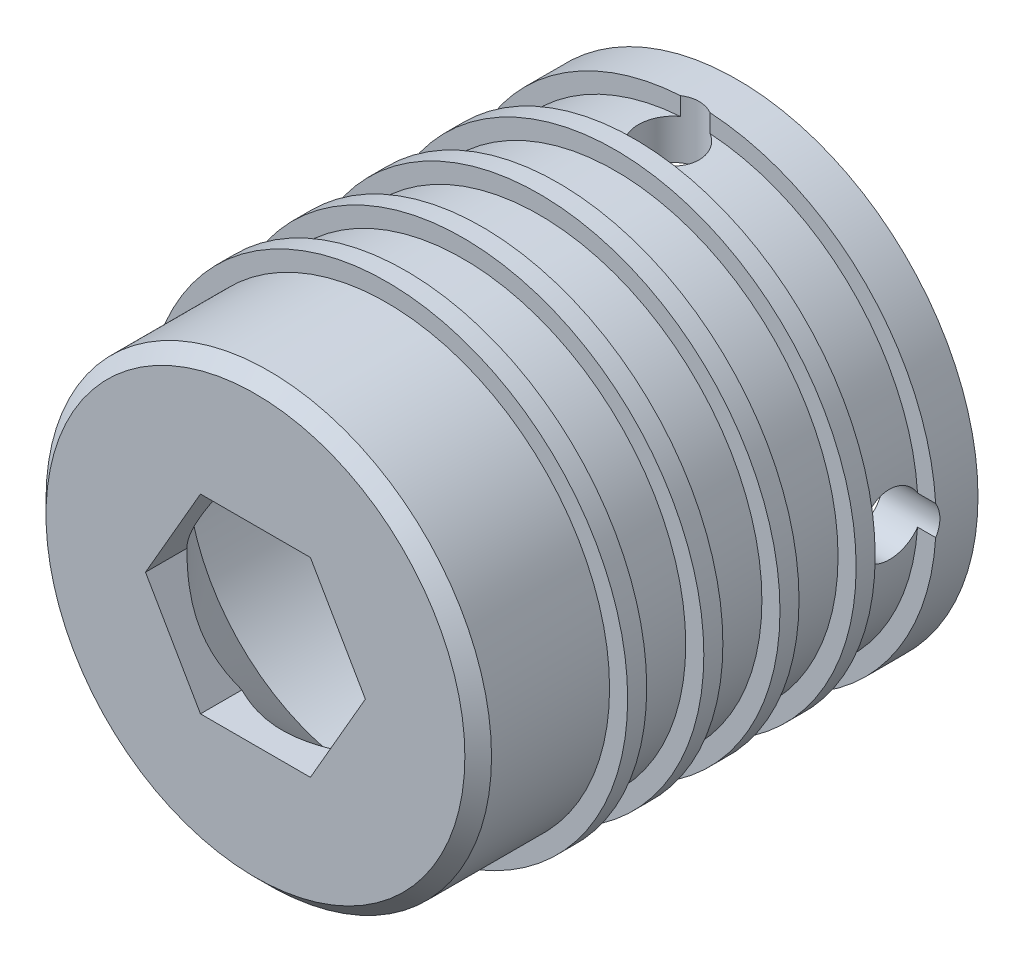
from build123d import *

# Parameters (mm, degrees)
SKETCH1_R           = 6.325
BOSS_EXTRUDE1_DEPTH = 12.65
SKETCH2_R           = 4.8
CUT_EXTRUDE1_DEPTH  = 9.65
CHAMFER1_SIZE       = 0.5
SKETCH6_R           = 0.8
CUT_EXTRUDE5_DEPTH  = 16.493022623
CIRPATTERN2_COUNT   = 2
CIRPATTERN2_ANGLE   = 90
SKETCH8_W           = 1.6
SKETCH8_H           = 0.475
SKETCH8_W_2         = 1.5
SKETCH8_W_3         = 5
CUT_EXTRUDE6_DEPTH  = 10
SKETCH10_OUTSIDE_W  = 52.018
SKETCH10_OUTSIDE_H  = 52.018
SKETCH10_OUTSIDE_R  = 5.5
CUT_EXTRUDE7_DEPTH  = 16.493022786
CUT_EXTRUDE7_DRAFT  = -45


with BuildPart() as part:
    # Sketch1 → Boss-Extrude1 (new body)
    with BuildSketch(Plane.XY):
        Circle(SKETCH1_R)
    extrude(amount=BOSS_EXTRUDE1_DEPTH)

    # Sketch2 → Cut-Extrude1 (cut)
    with BuildSketch(Plane(origin=(0, 0, 0), x_dir=(-1, 0, 0), z_dir=(0, 0, -1))):
        Circle(SKETCH2_R)
    extrude(amount=-CUT_EXTRUDE1_DEPTH, mode=Mode.SUBTRACT)

    # Cut-Extrude3 cone 1 section (on through the dimple's axis) → Cut-Extrude3 (revolve, cut)
    with BuildSketch(Plane(origin=(0, 0, 9.65), x_dir=(0, 1, 0), z_dir=(1, 0, 0))):
        Polygon((0, 0), (4.8, 0), (0, 4.8), align=None)
    revolve(axis=Axis((0, 0, 9.65), (0, 0, 1)), mode=Mode.SUBTRACT)

    # Chamfer1
    chamfer1_edges = [part.edges().sort_by_distance(p)[0] for p in [
        (4.8, 0, 0),
    ]]
    chamfer(chamfer1_edges, length=CHAMFER1_SIZE)

    # Sketch6 → Cut-Extrude5 (cut, symmetric)
    with BuildSketch(Plane(origin=(0, 0, 0), x_dir=(0, 0, -1), z_dir=(1, 0, 0))):
        with Locations((-1.8, 0)):
            Circle(SKETCH6_R)
    cut_extrude5 = extrude(amount=CUT_EXTRUDE5_DEPTH, both=True, mode=Mode.SUBTRACT)

    # CirPattern2: Cut-Extrude5 ×2 about axis
    cirpattern2_axis = Axis((0, 0, 12.65), (0, 0, -1))
    for i in range(1, CIRPATTERN2_COUNT):
        add(cut_extrude5.rotate(cirpattern2_axis, i * CIRPATTERN2_ANGLE / (CIRPATTERN2_COUNT - 1)), mode=Mode.SUBTRACT)

    # Sketch8 → Cut-Revolve3 (revolve, cut)
    with BuildSketch(Plane(origin=(0, 0, 0), x_dir=(0, 0, -1), z_dir=(1, 0, 0)), mode=Mode.PRIVATE) as cut_revolve3_sk:
        with Locations((-1.9, 6.0875)):
            Rectangle(SKETCH8_W, SKETCH8_H)
        with Locations((-3.95, 6.0875)):
            Rectangle(SKETCH8_W_2, SKETCH8_H)
        with Locations((-5.95, 6.0875)):
            Rectangle(SKETCH8_W_2, SKETCH8_H)
        with Locations((-7.95, 6.0875)):
            Rectangle(SKETCH8_W_2, SKETCH8_H)
        with Locations((-11.7, 6.0875)):
            Rectangle(SKETCH8_W_3, SKETCH8_H)
    revolve(cut_revolve3_sk.sketch.rotate(Axis((0, 0, 9.65), (0, 0, -1)), 90), axis=Axis((0, 0, 9.65), (0, 0, -1)), mode=Mode.SUBTRACT)

    # Sketch9 → Cut-Extrude6 (cut)
    with BuildSketch(Plane.XY.offset(12.65)):
        Polygon((1.443375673, 2.5), (-1.443375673, 2.5), (-2.886751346, 0), (-1.443375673, -2.5), (1.443375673, -2.5), (2.886751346, 0), align=None)
    extrude(amount=-CUT_EXTRUDE6_DEPTH, mode=Mode.SUBTRACT)


with BuildPart() as cut_extrude7_tool:
    # Sketch10 outside → Cut-Extrude7 (with draft: the straight prism first)
    with BuildSketch(Plane.XY.offset(12.65)):
        Rectangle(SKETCH10_OUTSIDE_W, SKETCH10_OUTSIDE_H)
        Circle(SKETCH10_OUTSIDE_R, mode=Mode.SUBTRACT)
    extrude(amount=-CUT_EXTRUDE7_DEPTH)
    # Cut-Extrude7: the draft: its side faces are tilted about the plane it starts from
    cut_extrude7_sides = [cut_extrude7_tool.faces().sort_by_distance(p)[0] for p in [
        (0, -26.009, 4.403488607),
        (26.009, 0, 4.403488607),
        (0, 26.009, 4.403488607),
        (-26.009, 0, 4.403488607),
        (-5.5, 0, 4.403488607),
    ]]
    draft(cut_extrude7_sides, Plane.XY.offset(12.65), CUT_EXTRUDE7_DRAFT)


with BuildPart() as part_1:
    add(part.part)

    # Cut-Extrude7: cut by cut_extrude7_tool
    add(cut_extrude7_tool.part, mode=Mode.SUBTRACT)


solid = part_1.part
